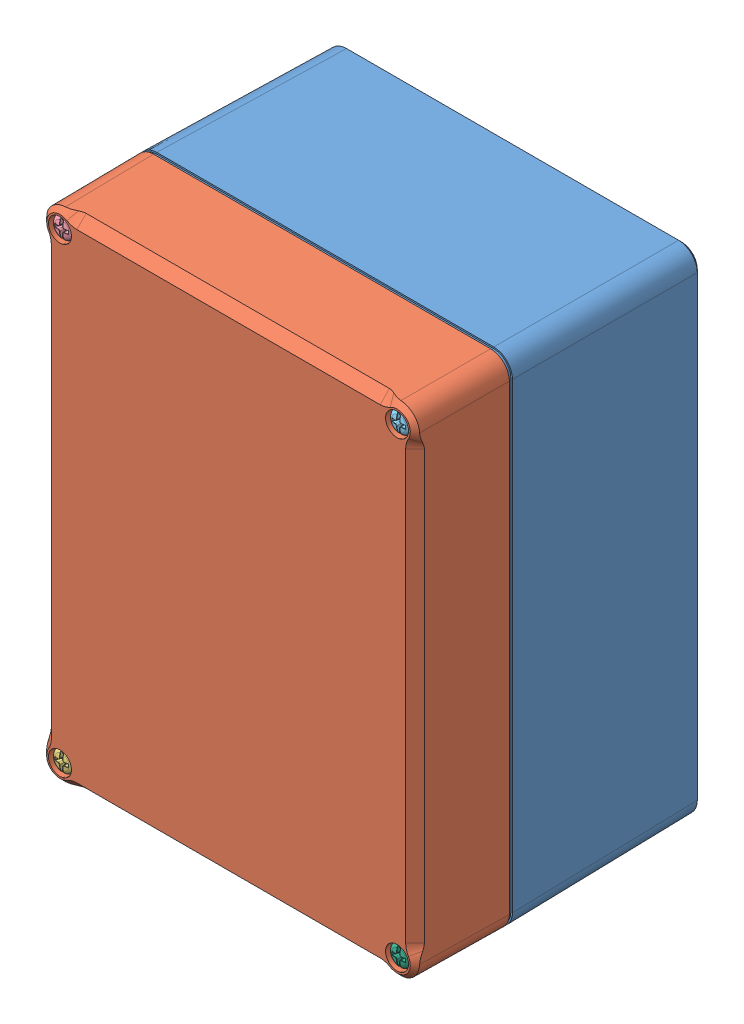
SolidWorks assembly 63238000.SLDASM, configuration Default (file format 8000). Lengths in mm.
Overall size (122.02 162.02 92.5).
6 component instances, 6 part files, 0 mates.
Components (placement in the parent):
- 63238000_01-1: 63238000_01.SLDPRT [Default] at origin size (120.95 160.95 64.5)
- 63238000_02-1: 63238000_02.SLDPRT [Default] at origin size (122.02 162.02 30)
- 63238000_03-1: 63238000_03.SLDPRT [Default] at origin size (7 7 37.9)
- 63238000_04-1: 63238000_04.SLDPRT [Default] at origin size (7 7 37.9)
- 63238000_05-1: 63238000_05.SLDPRT [Default] at origin size (7 7 37.9)
- 63238000_06-1: 63238000_06.SLDPRT [Default] at origin size (7 7 37.9)
